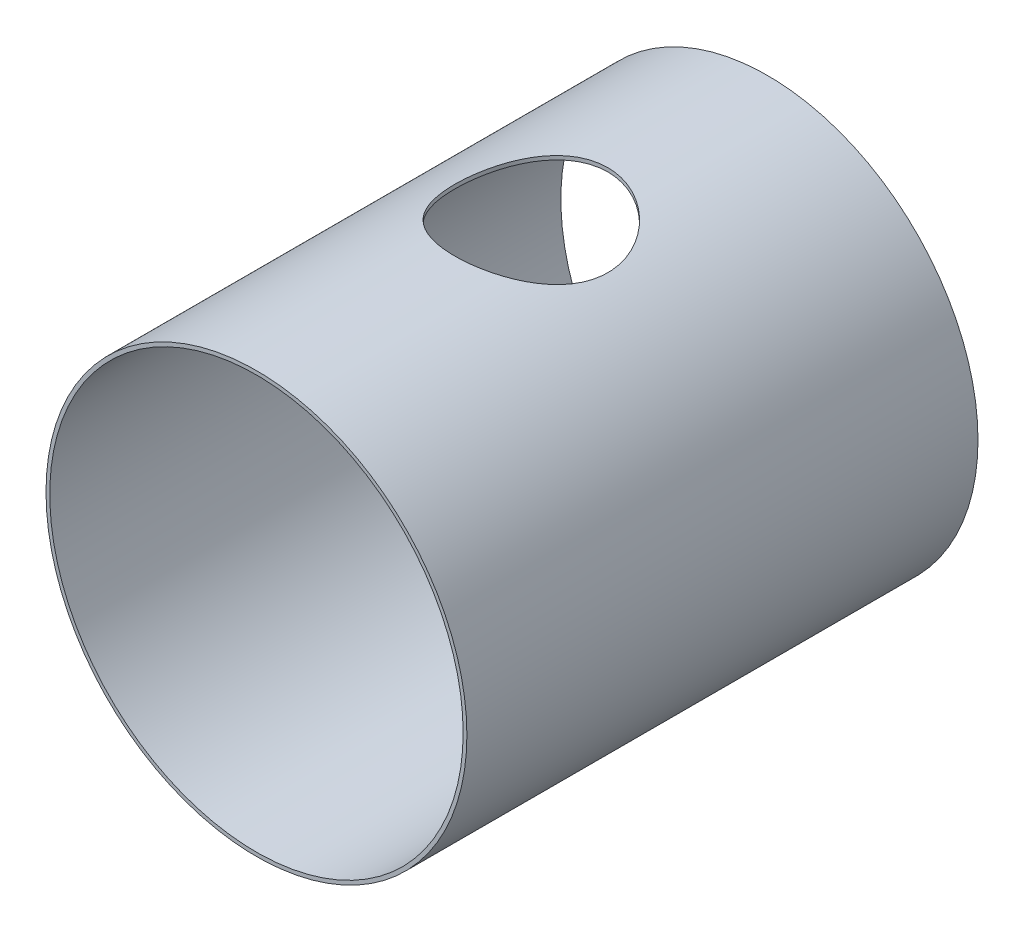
from build123d import *

# Parameters (mm, degrees)
SKETCH1_R           = 711.2
SKETCH1_R_2         = 698.5
EXTRUDE1_DEPTH      = 1727.2
SKETCH5_R           = 258.7625
NOZZLE_1_DEPTH      = 764.794
NOZZLE_2_DEPTH      = 60.96
NOZZLE_2_DEPTH_BACK = 180.34
SKETCH8_R           = 26.2509


with BuildPart() as part:
    # Sketch1 → Extrude1 (new body)
    with BuildSketch(Plane.XY):
        Circle(SKETCH1_R)
        Circle(SKETCH1_R_2, mode=Mode.SUBTRACT)
    extrude(amount=EXTRUDE1_DEPTH)

    # Sketch5 → Nozzle 1 (cut)
    with BuildSketch(Plane(origin=(0, 0, 0), x_dir=(1, 0, 0), z_dir=(0, 1, 0))):
        with Locations(Location((0, -798.41344, 0), (0, 0, 90))):
            Circle(SKETCH5_R)
    extrude(amount=NOZZLE_1_DEPTH, mode=Mode.SUBTRACT)

    # Sketch8 → Nozzle 2 (cut, two sides: drawn at the far end of the back side and taken through both)
    with BuildSketch(Plane(origin=(300, -519.615242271, -50.05436293), x_dir=(-0.8649310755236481, -0.4993681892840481, -0.05025580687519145), z_dir=(-0.49999999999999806, 0.8660254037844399, 0)).offset(-NOZZLE_2_DEPTH_BACK)):
        with Locations(Location((-32.086608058, 637.658904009, 0), (0, 0, 2.880659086))):
            Circle(SKETCH8_R)
    extrude(amount=NOZZLE_2_DEPTH + NOZZLE_2_DEPTH_BACK, mode=Mode.SUBTRACT)


solid = part.part
